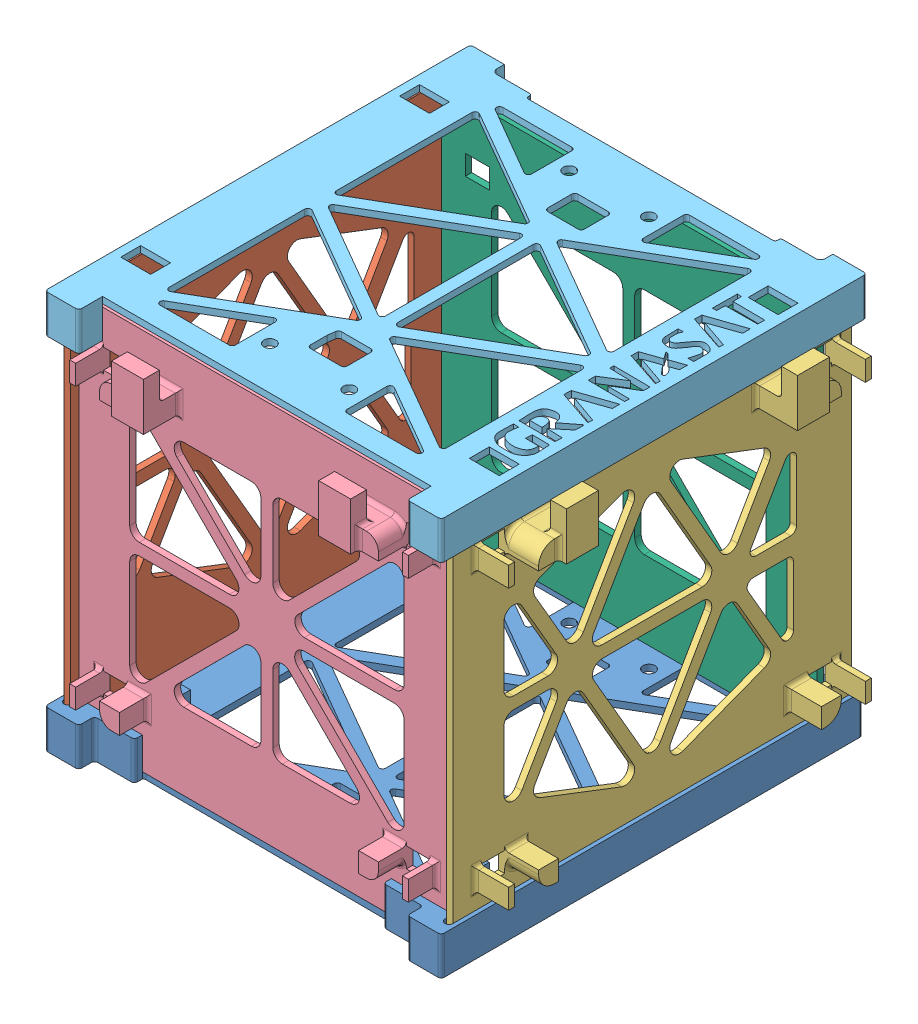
SolidWorks assembly Strcture_V1.SLDASM, configuration Default (file format 7000). Lengths in mm.
Overall size (108.95 99.89 109.83).
6 component instances, 6 part files, 12 mates.
Components (placement in the parent):
- Bottom_V1-1: Bottom_V1.SLDPRT [Predeterminado] at (-1.1992 147.973 11.4231) x (1 0 0) z (0 1 0) size (99.44 105.81 9.6)
- Left_V1-1: Left_V1.SLDPRT [Predeterminado] at (14.935 112.66 25.5405) x (0 1 0) z (-1 0 0) size (96.69 100.02 1.6)
- Right_V1-1: Right_V1.SLDPRT [Predeterminado] at (110.7963 112.66 25.4455) x (0 1 0) z (-1 0 0) size (96.69 100.02 12.1)
- Front_V1-1: Front_V1.SLDPRT [Predeterminado] at (-65.2977 242.941 -55.4482) x (0 -1 0) z (0 0 1) size (95.98 94.49 10.6)
- Top_V1-1: Top_V1.SLDPRT [Predeterminado] at (125.3305 244.6626 11.4231) x (-1 0 0) z (0 -1 0) size (99.44 106.81 9.6)
- Back_V1-1: Back_V1.SLDPRT [Predeterminado] at (189.3183 148.989 -146.389) x (0 1 0) z (0 0 1) size (95.98 94.49 1.6)
Mates (geometry in assembly coordinates):
- Coincident3: coincident anti-aligned: plane of Bottom_V1-1 through (-1.1992 147.973 11.4231) normal (0 1 0); plane of Left_V1-1 through (13.335 147.973 25.5405) normal (0 -1 0)
- Coincident5: coincident anti-aligned: plane of Bottom_V1-1 through (13.335 155.973 11.4231) normal (1 0 0); plane of Left_V1-1 through (13.335 112.66 25.5405) normal (-1 0 0)
- Coincident6: coincident anti-aligned: plane of Bottom_V1-1 through (-1.1992 147.973 11.4231) normal (0 1 0); plane of Right_V1-1 through (109.1963 147.973 25.4455) normal (0 -1 0)
- Coincident8: coincident anti-aligned: plane of Bottom_V1-1 through (110.7963 155.973 11.4231) normal (-1 0 0); plane of Right_V1-1 through (110.7963 112.66 25.4455) normal (1 0 0)
- Coincident9: coincident anti-aligned: plane of Bottom_V1-1 through (-1.1992 147.973 11.4231) normal (0 1 0); plane of Front_V1-1 through (-65.2977 147.973 -57.0482) normal (0 -1 0)
- Coincident10: coincident anti-aligned: plane of Bottom_V1-1 through (-1.1992 155.973 -55.4482) normal (0 0 -1); plane of Front_V1-1 through (-65.2977 242.941 -55.4482) normal (0 0 1)
- Coincident11: coincident anti-aligned: plane of Right_V1-1 through (109.1963 244.6626 25.4455) normal (0 1 0); plane of Top_V1-1 through (125.3305 244.6626 11.4231) normal (0 -1 0)
- Coincident14: coincident aligned: plane of Bottom_V1-1 through (12.3462 146.373 11.4231) normal (-1 0 0); plane of Top_V1-1 through (12.3462 236.6626 11.4231) normal (-1 0 0)
- Coincident15: coincident aligned: plane of Bottom_V1-1 through (111.7851 146.373 11.4231) normal (1 0 0); plane of Top_V1-1 through (111.7851 246.2626 11.4231) normal (1 0 0)
- Coincident18: coincident anti-aligned: plane of Bottom_V1-1 through (-1.1992 155.973 -147.989) normal (0 0 1); plane of Back_V1-1 through (189.3183 148.989 -147.989) normal (0 0 -1)
- Coincident19: coincident anti-aligned: plane of Bottom_V1-1 through (-1.1992 147.973 11.4231) normal (0 1 0); plane of Back_V1-1 through (189.3183 147.973 -147.989) normal (0 -1 0)
- Coincident20: coincident anti-aligned: plane of Right_V1-1 through (109.1963 112.66 25.4455) normal (-1 0 0); plane of Back_V1-1 through (109.1963 148.989 -147.989) normal (1 0 0)
